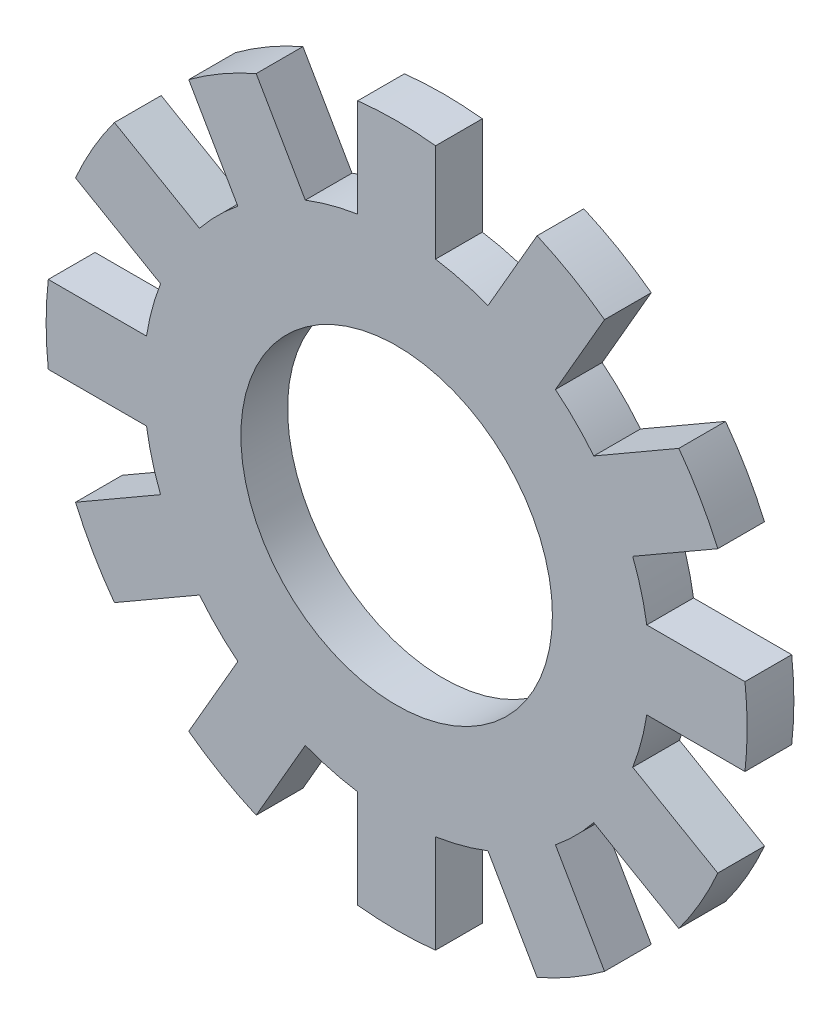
from build123d import *

# Parameters (mm, degrees)
SKETCH1_R                 = 1.625
SKETCH1_R_2               = 1
BOSS_EXTRUDE1_DEPTH       = 0.15
BOSS_EXTRUDE2_DEPTH       = 0.15
CIRPATTERN2_COUNT         = 12
CIRPATTERN2_COPY_1_DEPTH  = 0.15
CIRPATTERN2_COPY_2_DEPTH  = 0.15
CIRPATTERN2_COPY_3_DEPTH  = 0.15
CIRPATTERN2_COPY_4_DEPTH  = 0.15
CIRPATTERN2_COPY_5_DEPTH  = 0.15
CIRPATTERN2_COPY_6_DEPTH  = 0.15
CIRPATTERN2_COPY_7_DEPTH  = 0.15
CIRPATTERN2_COPY_8_DEPTH  = 0.15
CIRPATTERN2_COPY_9_DEPTH  = 0.15
CIRPATTERN2_COPY_10_DEPTH = 0.15
CIRPATTERN2_COPY_11_DEPTH = 0.15


with BuildPart() as part:
    # Sketch1 → Boss-Extrude1 (new, symmetric)
    with BuildSketch(Plane.XY):
        Circle(SKETCH1_R)
        Circle(SKETCH1_R_2, mode=Mode.SUBTRACT)
    extrude(amount=BOSS_EXTRUDE1_DEPTH, both=True)

    # Sketch3 → Boss-Extrude2 (add, symmetric)
    with BuildSketch(Plane.XY):
        with BuildLine():
            Line((-0.25, 2.236067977), (-0.25, 1.605654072))
            ThreePointArc((-0.25, 1.605654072), (-0.125373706, 1.620156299), (0, 1.625))
            Line((0, 1.625), (0, 2.25))
            ThreePointArc((0, 2.25), (-0.125193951, 2.246514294), (-0.25, 2.236067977))
        make_face()
    boss_extrude2 = extrude(amount=BOSS_EXTRUDE2_DEPTH, both=True)

    # Mirror1: Boss-Extrude2 across plane
    add(boss_extrude2.mirror(Plane(origin=(0, 0, 0), x_dir=(0, 0, 1), z_dir=(1, 0, 0))))

    # CirPattern2: Boss-Extrude2 ×12 about axis
    cirpattern2_axis = Axis((0, 0, 0), (0, 0, 1))
    for i in range(1, CIRPATTERN2_COUNT):
        add(boss_extrude2.rotate(cirpattern2_axis, i * 360 / CIRPATTERN2_COUNT))

    # CirPattern2 copy 1 sketch → CirPattern2 copy 1 (add, symmetric)
    with BuildSketch(Plane(origin=(0, 0, 0), x_dir=(-0.8660254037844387, -0.49999999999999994, 0), z_dir=(0, 0, 1))):
        with BuildLine():
            Line((-0.25, -2.236067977), (-0.25, -1.605654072))
            ThreePointArc((-0.25, -1.605654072), (-0.125373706, -1.620156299), (0, -1.625))
            Line((0, -1.625), (0, -2.25))
            ThreePointArc((0, -2.25), (-0.125193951, -2.246514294), (-0.25, -2.236067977))
        make_face()
    extrude(amount=CIRPATTERN2_COPY_1_DEPTH, both=True)

    # CirPattern2 copy 2 sketch → CirPattern2 copy 2 (add, symmetric)
    with BuildSketch(Plane(origin=(0, 0, 0), x_dir=(-0.5000000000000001, -0.8660254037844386, 0), z_dir=(0, 0, 1))):
        with BuildLine():
            Line((-0.25, -2.236067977), (-0.25, -1.605654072))
            ThreePointArc((-0.25, -1.605654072), (-0.125373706, -1.620156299), (0, -1.625))
            Line((0, -1.625), (0, -2.25))
            ThreePointArc((0, -2.25), (-0.125193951, -2.246514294), (-0.25, -2.236067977))
        make_face()
    extrude(amount=CIRPATTERN2_COPY_2_DEPTH, both=True)

    # CirPattern2 copy 3 sketch → CirPattern2 copy 3 (add, symmetric)
    with BuildSketch(Plane(origin=(0, 0, 0), x_dir=(0, -1, 0), z_dir=(0, 0, 1))):
        with BuildLine():
            Line((-0.25, -2.236067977), (-0.25, -1.605654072))
            ThreePointArc((-0.25, -1.605654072), (-0.125373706, -1.620156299), (0, -1.625))
            Line((0, -1.625), (0, -2.25))
            ThreePointArc((0, -2.25), (-0.125193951, -2.246514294), (-0.25, -2.236067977))
        make_face()
    extrude(amount=CIRPATTERN2_COPY_3_DEPTH, both=True)

    # CirPattern2 copy 4 sketch → CirPattern2 copy 4 (add, symmetric)
    with BuildSketch(Plane(origin=(0, 0, 0), x_dir=(0.4999999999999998, -0.8660254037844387, 0), z_dir=(0, 0, 1))):
        with BuildLine():
            Line((-0.25, -2.236067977), (-0.25, -1.605654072))
            ThreePointArc((-0.25, -1.605654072), (-0.125373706, -1.620156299), (0, -1.625))
            Line((0, -1.625), (0, -2.25))
            ThreePointArc((0, -2.25), (-0.125193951, -2.246514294), (-0.25, -2.236067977))
        make_face()
    extrude(amount=CIRPATTERN2_COPY_4_DEPTH, both=True)

    # CirPattern2 copy 5 sketch → CirPattern2 copy 5 (add, symmetric)
    with BuildSketch(Plane(origin=(0, 0, 0), x_dir=(0.8660254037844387, -0.49999999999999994, 0), z_dir=(0, 0, 1))):
        with BuildLine():
            Line((-0.25, -2.236067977), (-0.25, -1.605654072))
            ThreePointArc((-0.25, -1.605654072), (-0.125373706, -1.620156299), (0, -1.625))
            Line((0, -1.625), (0, -2.25))
            ThreePointArc((0, -2.25), (-0.125193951, -2.246514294), (-0.25, -2.236067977))
        make_face()
    extrude(amount=CIRPATTERN2_COPY_5_DEPTH, both=True)

    # CirPattern2 copy 6 sketch → CirPattern2 copy 6 (add, symmetric)
    with BuildSketch(Plane.XY):
        with BuildLine():
            Line((-0.25, -2.236067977), (-0.25, -1.605654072))
            ThreePointArc((-0.25, -1.605654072), (-0.125373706, -1.620156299), (0, -1.625))
            Line((0, -1.625), (0, -2.25))
            ThreePointArc((0, -2.25), (-0.125193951, -2.246514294), (-0.25, -2.236067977))
        make_face()
    extrude(amount=CIRPATTERN2_COPY_6_DEPTH, both=True)

    # CirPattern2 copy 7 sketch → CirPattern2 copy 7 (add, symmetric)
    with BuildSketch(Plane(origin=(0, 0, 0), x_dir=(0.8660254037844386, 0.5000000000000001, 0), z_dir=(0, 0, 1))):
        with BuildLine():
            Line((-0.25, -2.236067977), (-0.25, -1.605654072))
            ThreePointArc((-0.25, -1.605654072), (-0.125373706, -1.620156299), (0, -1.625))
            Line((0, -1.625), (0, -2.25))
            ThreePointArc((0, -2.25), (-0.125193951, -2.246514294), (-0.25, -2.236067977))
        make_face()
    extrude(amount=CIRPATTERN2_COPY_7_DEPTH, both=True)

    # CirPattern2 copy 8 sketch → CirPattern2 copy 8 (add, symmetric)
    with BuildSketch(Plane(origin=(0, 0, 0), x_dir=(0.5000000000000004, 0.8660254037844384, 0), z_dir=(0, 0, 1))):
        with BuildLine():
            Line((-0.25, -2.236067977), (-0.25, -1.605654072))
            ThreePointArc((-0.25, -1.605654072), (-0.125373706, -1.620156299), (0, -1.625))
            Line((0, -1.625), (0, -2.25))
            ThreePointArc((0, -2.25), (-0.125193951, -2.246514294), (-0.25, -2.236067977))
        make_face()
    extrude(amount=CIRPATTERN2_COPY_8_DEPTH, both=True)

    # CirPattern2 copy 9 sketch → CirPattern2 copy 9 (add, symmetric)
    with BuildSketch(Plane(origin=(0, 0, 0), x_dir=(0, 1, 0), z_dir=(0, 0, 1))):
        with BuildLine():
            Line((-0.25, -2.236067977), (-0.25, -1.605654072))
            ThreePointArc((-0.25, -1.605654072), (-0.125373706, -1.620156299), (0, -1.625))
            Line((0, -1.625), (0, -2.25))
            ThreePointArc((0, -2.25), (-0.125193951, -2.246514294), (-0.25, -2.236067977))
        make_face()
    extrude(amount=CIRPATTERN2_COPY_9_DEPTH, both=True)

    # CirPattern2 copy 10 sketch → CirPattern2 copy 10 (add, symmetric)
    with BuildSketch(Plane(origin=(0, 0, 0), x_dir=(-0.5000000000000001, 0.8660254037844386, 0), z_dir=(0, 0, 1))):
        with BuildLine():
            Line((-0.25, -2.236067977), (-0.25, -1.605654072))
            ThreePointArc((-0.25, -1.605654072), (-0.125373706, -1.620156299), (0, -1.625))
            Line((0, -1.625), (0, -2.25))
            ThreePointArc((0, -2.25), (-0.125193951, -2.246514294), (-0.25, -2.236067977))
        make_face()
    extrude(amount=CIRPATTERN2_COPY_10_DEPTH, both=True)

    # CirPattern2 copy 11 sketch → CirPattern2 copy 11 (add, symmetric)
    with BuildSketch(Plane(origin=(0, 0, 0), x_dir=(-0.8660254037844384, 0.5000000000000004, 0), z_dir=(0, 0, 1))):
        with BuildLine():
            Line((-0.25, -2.236067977), (-0.25, -1.605654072))
            ThreePointArc((-0.25, -1.605654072), (-0.125373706, -1.620156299), (0, -1.625))
            Line((0, -1.625), (0, -2.25))
            ThreePointArc((0, -2.25), (-0.125193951, -2.246514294), (-0.25, -2.236067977))
        make_face()
    extrude(amount=CIRPATTERN2_COPY_11_DEPTH, both=True)


solid = part.part
